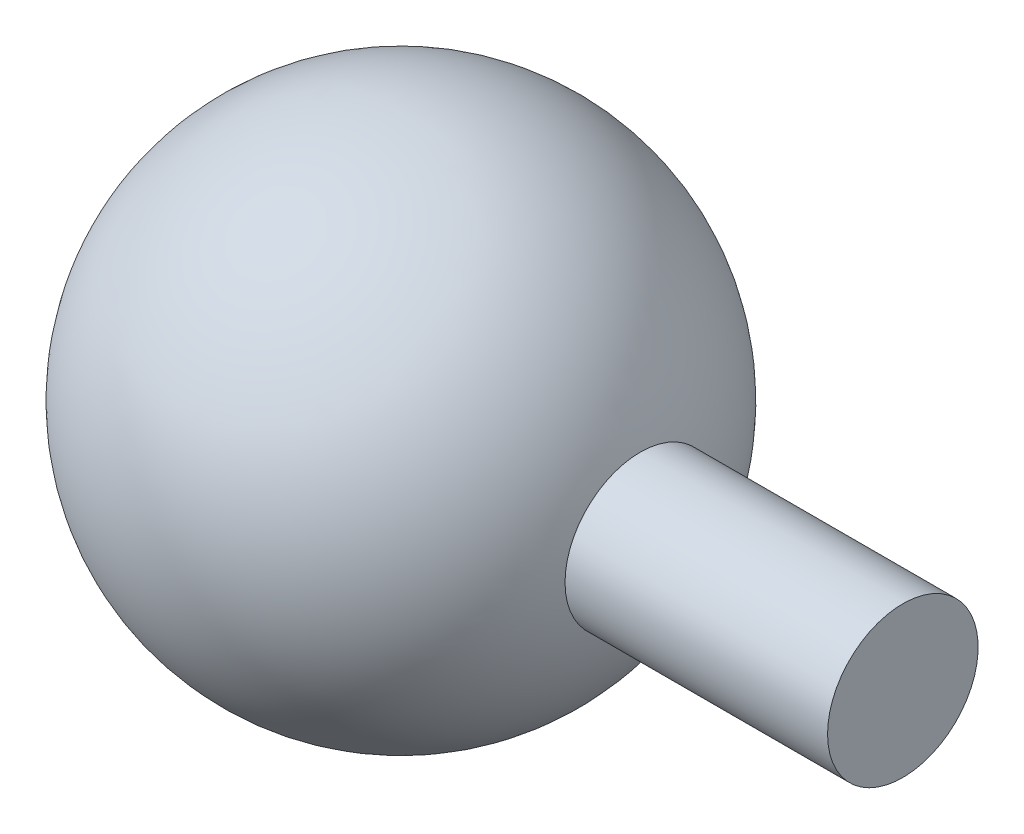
from build123d import *


with BuildPart() as part:
    # Skizze1 → Rotation1 (revolve)
    with BuildSketch(Plane.XY):
        with BuildLine():
            Line((47.696960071, 15), (100, 15))
            Line((100, 15), (100, 0))
            Line((100, 0), (-50, 0))
            ThreePointArc((-50, 0), (-7.587884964, 49.420886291), (47.696960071, 15))
        make_face()
    revolve(axis=Axis((0, 0, 0), (1, 0, 0)))


solid = part.part
